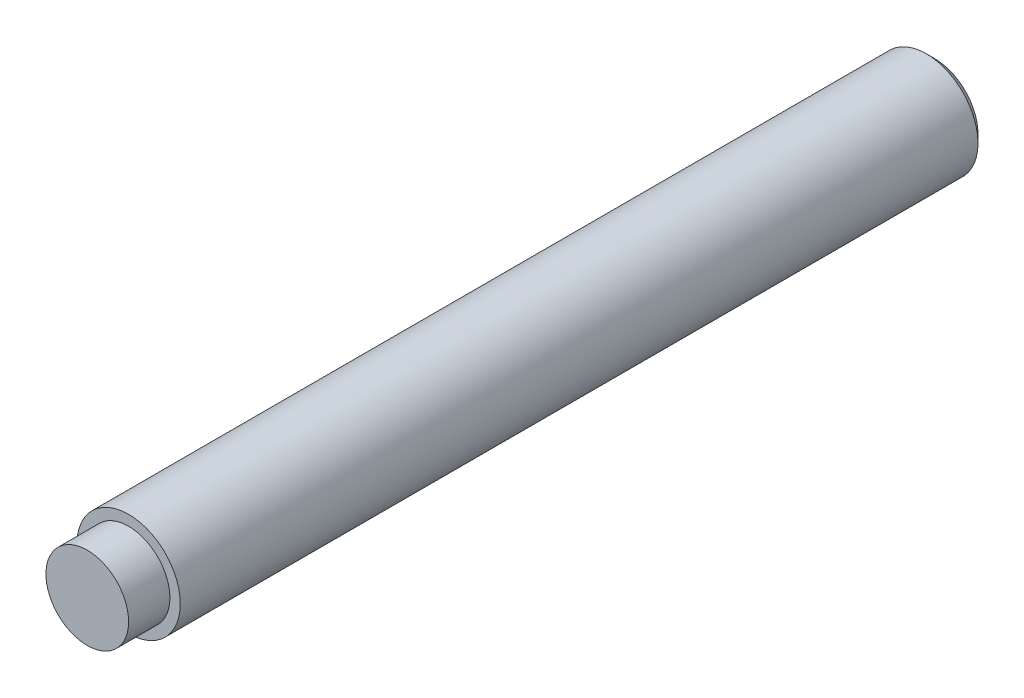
ISO-10303-21;
HEADER;
FILE_DESCRIPTION(('STEP AP214'),'2;1');
FILE_NAME('part.step','',(''),(''),'','','');
FILE_SCHEMA(('AUTOMOTIVE_DESIGN { 1 0 10303 214 1 1 1 1 }'));
ENDSEC;
DATA;
#1=APPLICATION_CONTEXT('core data for automotive mechanical design processes');
#2=APPLICATION_PROTOCOL_DEFINITION('international standard','automotive_design',2000,#1);
#3=PRODUCT_CONTEXT('',#1,'mechanical');
#4=PRODUCT('Part','Part','',(#3));
#5=PRODUCT_RELATED_PRODUCT_CATEGORY('part','',(#4));
#6=PRODUCT_DEFINITION_FORMATION('','',#4);
#7=PRODUCT_DEFINITION_CONTEXT('part definition',#1,'design');
#8=PRODUCT_DEFINITION('design','',#6,#7);
#9=PRODUCT_DEFINITION_SHAPE('','',#8);
#10=(LENGTH_UNIT() NAMED_UNIT(*) SI_UNIT(.MILLI.,.METRE.));
#11=(NAMED_UNIT(*) PLANE_ANGLE_UNIT() SI_UNIT($,.RADIAN.));
#12=(NAMED_UNIT(*) SI_UNIT($,.STERADIAN.) SOLID_ANGLE_UNIT());
#13=UNCERTAINTY_MEASURE_WITH_UNIT(LENGTH_MEASURE(1.E-05),#10,'distance_accuracy_value','');
#14=(GEOMETRIC_REPRESENTATION_CONTEXT(3) GLOBAL_UNCERTAINTY_ASSIGNED_CONTEXT((#13)) GLOBAL_UNIT_ASSIGNED_CONTEXT((#10,
#11,#12)) REPRESENTATION_CONTEXT('',''));
#15=CARTESIAN_POINT('',(0.,0.,0.));
#16=DIRECTION('',(0.,0.,1.));
#17=DIRECTION('',(1.,0.,0.));
#18=AXIS2_PLACEMENT_3D('',#15,#16,#17);
#19=CARTESIAN_POINT('',(0.,0.,39.));
#20=DIRECTION('',(0.,0.,1.));
#21=DIRECTION('',(1.,0.,0.));
#22=AXIS2_PLACEMENT_3D('',#19,#20,#21);
#23=PLANE('',#22);
#24=CARTESIAN_POINT('',(0.,0.,39.));
#25=DIRECTION('',(0.,0.,1.));
#26=DIRECTION('',(1.,0.,0.));
#27=AXIS2_PLACEMENT_3D('',#24,#25,#26);
#28=CIRCLE('',#27,2.5);
#29=CARTESIAN_POINT('',(2.5,0.,39.));
#30=VERTEX_POINT('',#29);
#31=EDGE_CURVE('E41',#30,#30,#28,.T.);
#32=ORIENTED_EDGE('',*,*,#31,.T.);
#33=EDGE_LOOP('',(#32));
#34=FACE_BOUND('',#33,.T.);
#35=CARTESIAN_POINT('',(0.,0.,39.));
#36=DIRECTION('',(0.,0.,1.));
#37=DIRECTION('',(1.,0.,0.));
#38=AXIS2_PLACEMENT_3D('',#35,#36,#37);
#39=CIRCLE('',#38,2.);
#40=CARTESIAN_POINT('',(2.,0.,39.));
#41=VERTEX_POINT('',#40);
#42=EDGE_CURVE('E50',#41,#41,#39,.T.);
#43=ORIENTED_EDGE('',*,*,#42,.F.);
#44=EDGE_LOOP('',(#43));
#45=FACE_BOUND('',#44,.T.);
#46=ADVANCED_FACE('F30',(#34,#45),#23,.T.);
#47=CARTESIAN_POINT('',(0.,0.,39.));
#48=DIRECTION('',(0.,0.,-1.));
#49=DIRECTION('',(-1.,0.,0.));
#50=AXIS2_PLACEMENT_3D('',#47,#48,#49);
#51=CYLINDRICAL_SURFACE('',#50,2.5);
#52=CARTESIAN_POINT('',(0.,0.,0.399999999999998));
#53=DIRECTION('',(0.,0.,1.));
#54=DIRECTION('',(1.,0.,0.));
#55=AXIS2_PLACEMENT_3D('',#52,#53,#54);
#56=CIRCLE('',#55,2.5);
#57=CARTESIAN_POINT('',(2.5,0.,0.399999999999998));
#58=VERTEX_POINT('',#57);
#59=EDGE_CURVE('E37',#58,#58,#56,.T.);
#60=ORIENTED_EDGE('',*,*,#59,.T.);
#61=EDGE_LOOP('',(#60));
#62=FACE_BOUND('',#61,.T.);
#63=ORIENTED_EDGE('',*,*,#31,.F.);
#64=EDGE_LOOP('',(#63));
#65=FACE_BOUND('',#64,.T.);
#66=ADVANCED_FACE('F32',(#62,#65),#51,.T.);
#67=CARTESIAN_POINT('',(0.,0.,0.));
#68=DIRECTION('',(0.,0.,1.));
#69=DIRECTION('',(1.,0.,0.));
#70=AXIS2_PLACEMENT_3D('',#67,#68,#69);
#71=PLANE('',#70);
#72=CARTESIAN_POINT('',(0.,0.,0.));
#73=DIRECTION('',(0.,0.,1.));
#74=DIRECTION('',(1.,0.,0.));
#75=AXIS2_PLACEMENT_3D('',#72,#73,#74);
#76=CIRCLE('',#75,2.1);
#77=CARTESIAN_POINT('',(2.1,0.,0.));
#78=VERTEX_POINT('',#77);
#79=EDGE_CURVE('E10',#78,#78,#76,.F.);
#80=ORIENTED_EDGE('',*,*,#79,.T.);
#81=EDGE_LOOP('',(#80));
#82=FACE_BOUND('',#81,.T.);
#83=ADVANCED_FACE('F61',(#82),#71,.F.);
#84=CARTESIAN_POINT('',(0.,0.,41.));
#85=DIRECTION('',(0.,0.,-1.));
#86=DIRECTION('',(-1.,0.,0.));
#87=AXIS2_PLACEMENT_3D('',#84,#85,#86);
#88=CYLINDRICAL_SURFACE('',#87,2.);
#89=CARTESIAN_POINT('',(0.,0.,41.));
#90=DIRECTION('',(0.,0.,1.));
#91=DIRECTION('',(1.,0.,0.));
#92=AXIS2_PLACEMENT_3D('',#89,#90,#91);
#93=CIRCLE('',#92,2.);
#94=CARTESIAN_POINT('',(2.,0.,41.));
#95=VERTEX_POINT('',#94);
#96=EDGE_CURVE('E45',#95,#95,#93,.T.);
#97=ORIENTED_EDGE('',*,*,#96,.F.);
#98=EDGE_LOOP('',(#97));
#99=FACE_BOUND('',#98,.T.);
#100=ORIENTED_EDGE('',*,*,#42,.T.);
#101=EDGE_LOOP('',(#100));
#102=FACE_BOUND('',#101,.T.);
#103=ADVANCED_FACE('F54',(#99,#102),#88,.T.);
#104=CARTESIAN_POINT('',(0.,0.,41.));
#105=DIRECTION('',(0.,0.,1.));
#106=DIRECTION('',(1.,0.,0.));
#107=AXIS2_PLACEMENT_3D('',#104,#105,#106);
#108=PLANE('',#107);
#109=ORIENTED_EDGE('',*,*,#96,.T.);
#110=EDGE_LOOP('',(#109));
#111=FACE_BOUND('',#110,.T.);
#112=ADVANCED_FACE('F67',(#111),#108,.T.);
#113=CARTESIAN_POINT('',(0.,0.,0.399999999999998));
#114=DIRECTION('',(0.,0.,1.));
#115=DIRECTION('',(1.,0.,0.));
#116=AXIS2_PLACEMENT_3D('',#113,#114,#115);
#117=CONICAL_SURFACE('',#116,2.5,0.785398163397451);
#118=ORIENTED_EDGE('',*,*,#79,.F.);
#119=EDGE_LOOP('',(#118));
#120=FACE_BOUND('',#119,.T.);
#121=ORIENTED_EDGE('',*,*,#59,.F.);
#122=EDGE_LOOP('',(#121));
#123=FACE_BOUND('',#122,.T.);
#124=ADVANCED_FACE('F71',(#120,#123),#117,.T.);
#125=CLOSED_SHELL('',(#46,#66,#83,#103,#112,#124));
#126=MANIFOLD_SOLID_BREP('B2',#125);
#127=ADVANCED_BREP_SHAPE_REPRESENTATION('',(#18,#126),#14);
#128=SHAPE_DEFINITION_REPRESENTATION(#9,#127);
ENDSEC;
END-ISO-10303-21;
